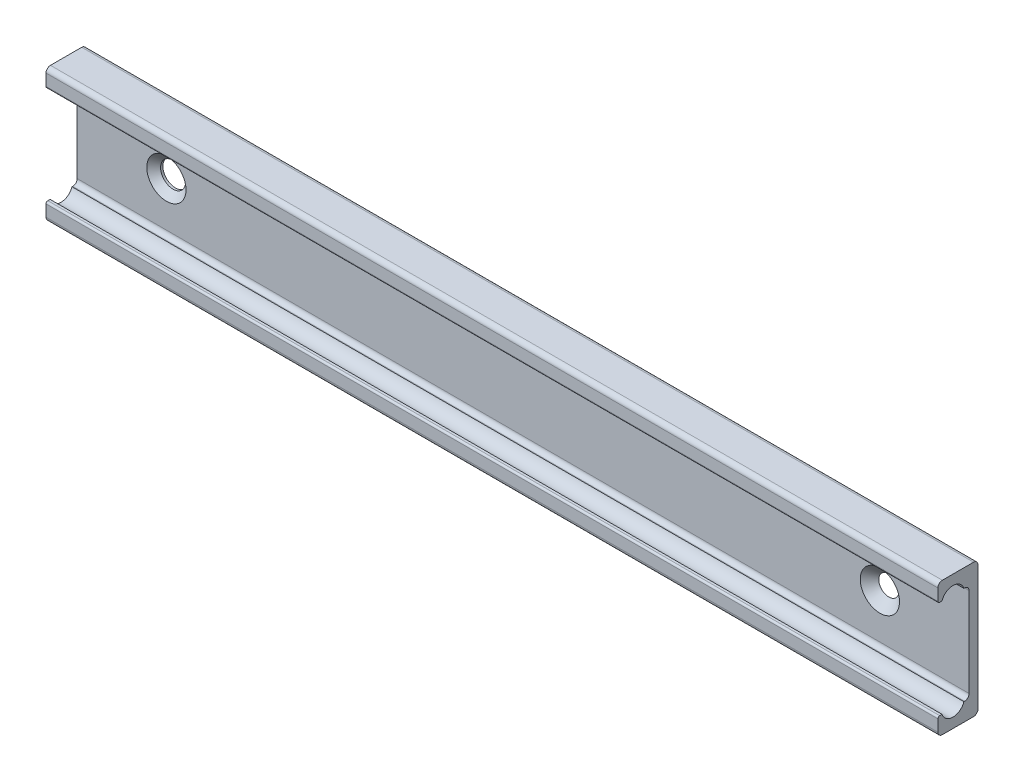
ISO-10303-21;
HEADER;
FILE_DESCRIPTION(('STEP AP214'),'2;1');
FILE_NAME('part.step','',(''),(''),'','','');
FILE_SCHEMA(('AUTOMOTIVE_DESIGN { 1 0 10303 214 1 1 1 1 }'));
ENDSEC;
DATA;
#1=APPLICATION_CONTEXT('core data for automotive mechanical design processes');
#2=APPLICATION_PROTOCOL_DEFINITION('international standard','automotive_design',2000,#1);
#3=PRODUCT_CONTEXT('',#1,'mechanical');
#4=PRODUCT('Part','Part','',(#3));
#5=PRODUCT_RELATED_PRODUCT_CATEGORY('part','',(#4));
#6=PRODUCT_DEFINITION_FORMATION('','',#4);
#7=PRODUCT_DEFINITION_CONTEXT('part definition',#1,'design');
#8=PRODUCT_DEFINITION('design','',#6,#7);
#9=PRODUCT_DEFINITION_SHAPE('','',#8);
#10=(LENGTH_UNIT() NAMED_UNIT(*) SI_UNIT(.MILLI.,.METRE.));
#11=(NAMED_UNIT(*) PLANE_ANGLE_UNIT() SI_UNIT($,.RADIAN.));
#12=(NAMED_UNIT(*) SI_UNIT($,.STERADIAN.) SOLID_ANGLE_UNIT());
#13=UNCERTAINTY_MEASURE_WITH_UNIT(LENGTH_MEASURE(1.E-05),#10,'distance_accuracy_value','');
#14=(GEOMETRIC_REPRESENTATION_CONTEXT(3) GLOBAL_UNCERTAINTY_ASSIGNED_CONTEXT((#13)) GLOBAL_UNIT_ASSIGNED_CONTEXT((#10,
#11,#12)) REPRESENTATION_CONTEXT('',''));
#15=CARTESIAN_POINT('',(0.,0.,0.));
#16=DIRECTION('',(0.,0.,1.));
#17=DIRECTION('',(1.,0.,0.));
#18=AXIS2_PLACEMENT_3D('',#15,#16,#17);
#19=CARTESIAN_POINT('',(90.,5.69999999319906,4.5));
#20=DIRECTION('',(0.,0.,1.));
#21=DIRECTION('',(1.,0.,0.));
#22=AXIS2_PLACEMENT_3D('',#19,#20,#21);
#23=PLANE('',#22);
#24=DIRECTION('',(0.,1.,0.));
#25=VECTOR('',#24,1.);
#26=CARTESIAN_POINT('',(-10.,5.69999999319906,4.5));
#27=LINE('',#26,#25);
#28=CARTESIAN_POINT('',(-10.,5.69999999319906,4.5));
#29=VERTEX_POINT('',#28);
#30=CARTESIAN_POINT('',(-10.,7.,4.5));
#31=VERTEX_POINT('',#30);
#32=EDGE_CURVE('E258',#29,#31,#27,.T.);
#33=ORIENTED_EDGE('',*,*,#32,.F.);
#34=DIRECTION('',(-1.,0.,0.));
#35=VECTOR('',#34,1.);
#36=CARTESIAN_POINT('',(90.,5.69999999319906,4.5));
#37=LINE('',#36,#35);
#38=CARTESIAN_POINT('',(90.,5.69999999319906,4.5));
#39=VERTEX_POINT('',#38);
#40=EDGE_CURVE('E9',#39,#29,#37,.T.);
#41=ORIENTED_EDGE('',*,*,#40,.F.);
#42=DIRECTION('',(0.,1.,0.));
#43=VECTOR('',#42,1.);
#44=CARTESIAN_POINT('',(90.,5.69999999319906,4.5));
#45=LINE('',#44,#43);
#46=CARTESIAN_POINT('',(90.,7.,4.5));
#47=VERTEX_POINT('',#46);
#48=EDGE_CURVE('E197',#39,#47,#45,.T.);
#49=ORIENTED_EDGE('',*,*,#48,.T.);
#50=DIRECTION('',(-1.,0.,0.));
#51=VECTOR('',#50,1.);
#52=CARTESIAN_POINT('',(94.5334865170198,7.,4.5));
#53=LINE('',#52,#51);
#54=EDGE_CURVE('E294',#47,#31,#53,.T.);
#55=ORIENTED_EDGE('',*,*,#54,.T.);
#56=EDGE_LOOP('',(#33,#41,#49,#55));
#57=FACE_BOUND('',#56,.T.);
#58=ADVANCED_FACE('F14',(#57),#23,.T.);
#59=CARTESIAN_POINT('',(90.,5.69999999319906,4.3));
#60=DIRECTION('',(-1.,0.,0.));
#61=DIRECTION('',(0.,0.,1.));
#62=AXIS2_PLACEMENT_3D('',#59,#60,#61);
#63=CYLINDRICAL_SURFACE('',#62,0.2);
#64=CARTESIAN_POINT('',(-10.,5.69999999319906,4.3));
#65=DIRECTION('',(-1.,0.,0.));
#66=DIRECTION('',(0.,0.,-1.));
#67=AXIS2_PLACEMENT_3D('',#64,#65,#66);
#68=CIRCLE('',#67,0.2);
#69=CARTESIAN_POINT('',(-10.,5.49999999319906,4.3));
#70=VERTEX_POINT('',#69);
#71=EDGE_CURVE('E255',#70,#29,#68,.T.);
#72=ORIENTED_EDGE('',*,*,#71,.F.);
#73=DIRECTION('',(-1.,0.,0.));
#74=VECTOR('',#73,1.);
#75=CARTESIAN_POINT('',(90.,5.49999999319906,4.3));
#76=LINE('',#75,#74);
#77=CARTESIAN_POINT('',(90.,5.49999999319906,4.3));
#78=VERTEX_POINT('',#77);
#79=EDGE_CURVE('E23',#78,#70,#76,.T.);
#80=ORIENTED_EDGE('',*,*,#79,.F.);
#81=CARTESIAN_POINT('',(90.,5.69999999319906,4.3));
#82=DIRECTION('',(-1.,0.,0.));
#83=DIRECTION('',(0.,0.,-1.));
#84=AXIS2_PLACEMENT_3D('',#81,#82,#83);
#85=CIRCLE('',#84,0.2);
#86=EDGE_CURVE('E194',#78,#39,#85,.T.);
#87=ORIENTED_EDGE('',*,*,#86,.T.);
#88=ORIENTED_EDGE('',*,*,#40,.T.);
#89=EDGE_LOOP('',(#72,#80,#87,#88));
#90=FACE_BOUND('',#89,.T.);
#91=ADVANCED_FACE('F330',(#90),#63,.T.);
#92=CARTESIAN_POINT('',(90.,5.49999999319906,3.97687617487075));
#93=DIRECTION('',(0.,-1.,0.));
#94=DIRECTION('',(1.,0.,0.));
#95=AXIS2_PLACEMENT_3D('',#92,#93,#94);
#96=PLANE('',#95);
#97=DIRECTION('',(-1.,0.,0.));
#98=VECTOR('',#97,1.);
#99=CARTESIAN_POINT('',(90.,5.49999999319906,4.03641754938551));
#100=LINE('',#99,#98);
#101=CARTESIAN_POINT('',(90.,5.49999999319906,4.03641754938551));
#102=VERTEX_POINT('',#101);
#103=CARTESIAN_POINT('',(-10.,5.49999999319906,4.03641754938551));
#104=VERTEX_POINT('',#103);
#105=EDGE_CURVE('E31',#102,#104,#100,.T.);
#106=ORIENTED_EDGE('',*,*,#105,.F.);
#107=DIRECTION('',(0.,0.,1.));
#108=VECTOR('',#107,1.);
#109=CARTESIAN_POINT('',(90.,5.49999999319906,3.97687617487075));
#110=LINE('',#109,#108);
#111=EDGE_CURVE('E192',#102,#78,#110,.T.);
#112=ORIENTED_EDGE('',*,*,#111,.T.);
#113=ORIENTED_EDGE('',*,*,#79,.T.);
#114=DIRECTION('',(0.,0.,1.));
#115=VECTOR('',#114,1.);
#116=CARTESIAN_POINT('',(-10.,5.49999999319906,3.97687617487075));
#117=LINE('',#116,#115);
#118=EDGE_CURVE('E253',#104,#70,#117,.T.);
#119=ORIENTED_EDGE('',*,*,#118,.F.);
#120=EDGE_LOOP('',(#106,#112,#113,#119));
#121=FACE_BOUND('',#120,.T.);
#122=ADVANCED_FACE('F394',(#121),#96,.T.);
#123=CARTESIAN_POINT('',(90.,5.5,1.5));
#124=DIRECTION('',(0.,-1.,-4.7517935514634E-08));
#125=DIRECTION('',(0.,-4.7517935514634E-08,1.));
#126=AXIS2_PLACEMENT_3D('',#123,#124,#125);
#127=PLANE('',#126);
#128=DIRECTION('',(-1.,0.,0.));
#129=VECTOR('',#128,1.);
#130=CARTESIAN_POINT('',(90.,5.49999999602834,1.58358245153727));
#131=LINE('',#130,#129);
#132=CARTESIAN_POINT('',(-10.,5.49999999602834,1.58358245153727));
#133=VERTEX_POINT('',#132);
#134=CARTESIAN_POINT('',(90.,5.49999999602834,1.58358245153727));
#135=VERTEX_POINT('',#134);
#136=EDGE_CURVE('E168',#133,#135,#131,.F.);
#137=ORIENTED_EDGE('',*,*,#136,.F.);
#138=DIRECTION('',(0.,-4.7517935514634E-08,1.));
#139=VECTOR('',#138,1.);
#140=CARTESIAN_POINT('',(-10.,5.5,1.5));
#141=LINE('',#140,#139);
#142=CARTESIAN_POINT('',(-10.,5.5,1.5));
#143=VERTEX_POINT('',#142);
#144=EDGE_CURVE('E250',#143,#133,#141,.T.);
#145=ORIENTED_EDGE('',*,*,#144,.F.);
#146=DIRECTION('',(-1.,0.,0.));
#147=VECTOR('',#146,1.);
#148=CARTESIAN_POINT('',(90.,5.5,1.5));
#149=LINE('',#148,#147);
#150=CARTESIAN_POINT('',(90.,5.5,1.5));
#151=VERTEX_POINT('',#150);
#152=EDGE_CURVE('E202',#151,#143,#149,.T.);
#153=ORIENTED_EDGE('',*,*,#152,.F.);
#154=DIRECTION('',(0.,-4.7517935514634E-08,1.));
#155=VECTOR('',#154,1.);
#156=CARTESIAN_POINT('',(90.,5.5,1.5));
#157=LINE('',#156,#155);
#158=EDGE_CURVE('E189',#151,#135,#157,.T.);
#159=ORIENTED_EDGE('',*,*,#158,.T.);
#160=EDGE_LOOP('',(#137,#145,#153,#159));
#161=FACE_BOUND('',#160,.T.);
#162=ADVANCED_FACE('F382',(#161),#127,.T.);
#163=CARTESIAN_POINT('',(90.,5.,1.5));
#164=DIRECTION('',(-1.,0.,0.));
#165=DIRECTION('',(0.,0.,1.));
#166=AXIS2_PLACEMENT_3D('',#163,#164,#165);
#167=CYLINDRICAL_SURFACE('',#166,0.5);
#168=CARTESIAN_POINT('',(-10.,5.,1.5));
#169=DIRECTION('',(1.,0.,0.));
#170=DIRECTION('',(0.,0.,1.));
#171=AXIS2_PLACEMENT_3D('',#168,#169,#170);
#172=CIRCLE('',#171,0.5);
#173=CARTESIAN_POINT('',(-10.,5.,1.));
#174=VERTEX_POINT('',#173);
#175=EDGE_CURVE('E247',#174,#143,#172,.T.);
#176=ORIENTED_EDGE('',*,*,#175,.F.);
#177=DIRECTION('',(-1.,0.,0.));
#178=VECTOR('',#177,1.);
#179=CARTESIAN_POINT('',(90.,5.,1.));
#180=LINE('',#179,#178);
#181=CARTESIAN_POINT('',(90.,5.,1.));
#182=VERTEX_POINT('',#181);
#183=EDGE_CURVE('E204',#182,#174,#180,.T.);
#184=ORIENTED_EDGE('',*,*,#183,.F.);
#185=CARTESIAN_POINT('',(90.,5.,1.5));
#186=DIRECTION('',(1.,0.,0.));
#187=DIRECTION('',(0.,0.,1.));
#188=AXIS2_PLACEMENT_3D('',#185,#186,#187);
#189=CIRCLE('',#188,0.5);
#190=EDGE_CURVE('E186',#182,#151,#189,.T.);
#191=ORIENTED_EDGE('',*,*,#190,.T.);
#192=ORIENTED_EDGE('',*,*,#152,.T.);
#193=EDGE_LOOP('',(#176,#184,#191,#192));
#194=FACE_BOUND('',#193,.T.);
#195=ADVANCED_FACE('F385',(#194),#167,.F.);
#196=CARTESIAN_POINT('',(90.,-5.,1.));
#197=DIRECTION('',(0.,0.,1.));
#198=DIRECTION('',(1.,0.,0.));
#199=AXIS2_PLACEMENT_3D('',#196,#197,#198);
#200=PLANE('',#199);
#201=CARTESIAN_POINT('',(80.,0.,1.));
#202=DIRECTION('',(0.,0.,1.));
#203=DIRECTION('',(1.,0.,0.));
#204=AXIS2_PLACEMENT_3D('',#201,#202,#203);
#205=CIRCLE('',#204,2.2);
#206=CARTESIAN_POINT('',(82.2,0.,1.));
#207=VERTEX_POINT('',#206);
#208=EDGE_CURVE('E226',#207,#207,#205,.T.);
#209=ORIENTED_EDGE('',*,*,#208,.F.);
#210=EDGE_LOOP('',(#209));
#211=FACE_BOUND('',#210,.T.);
#212=CARTESIAN_POINT('',(0.,0.,1.));
#213=DIRECTION('',(0.,0.,1.));
#214=DIRECTION('',(1.,0.,0.));
#215=AXIS2_PLACEMENT_3D('',#212,#213,#214);
#216=CIRCLE('',#215,2.2);
#217=CARTESIAN_POINT('',(2.2,0.,1.));
#218=VERTEX_POINT('',#217);
#219=EDGE_CURVE('E214',#218,#218,#216,.T.);
#220=ORIENTED_EDGE('',*,*,#219,.F.);
#221=EDGE_LOOP('',(#220));
#222=FACE_BOUND('',#221,.T.);
#223=DIRECTION('',(0.,1.,0.));
#224=VECTOR('',#223,1.);
#225=CARTESIAN_POINT('',(-10.,-5.,1.));
#226=LINE('',#225,#224);
#227=CARTESIAN_POINT('',(-10.,-5.,1.));
#228=VERTEX_POINT('',#227);
#229=EDGE_CURVE('E244',#228,#174,#226,.T.);
#230=ORIENTED_EDGE('',*,*,#229,.F.);
#231=DIRECTION('',(-1.,0.,0.));
#232=VECTOR('',#231,1.);
#233=CARTESIAN_POINT('',(90.,-5.,1.));
#234=LINE('',#233,#232);
#235=CARTESIAN_POINT('',(90.,-5.,1.));
#236=VERTEX_POINT('',#235);
#237=EDGE_CURVE('E206',#236,#228,#234,.T.);
#238=ORIENTED_EDGE('',*,*,#237,.F.);
#239=DIRECTION('',(0.,1.,0.));
#240=VECTOR('',#239,1.);
#241=CARTESIAN_POINT('',(90.,-5.,1.));
#242=LINE('',#241,#240);
#243=EDGE_CURVE('E178',#236,#182,#242,.T.);
#244=ORIENTED_EDGE('',*,*,#243,.T.);
#245=ORIENTED_EDGE('',*,*,#183,.T.);
#246=EDGE_LOOP('',(#230,#238,#244,#245));
#247=FACE_BOUND('',#246,.T.);
#248=ADVANCED_FACE('F388',(#211,#222,#247),#200,.T.);
#249=CARTESIAN_POINT('',(90.,-5.,1.5));
#250=DIRECTION('',(-1.,0.,0.));
#251=DIRECTION('',(0.,0.,1.));
#252=AXIS2_PLACEMENT_3D('',#249,#250,#251);
#253=CYLINDRICAL_SURFACE('',#252,0.5);
#254=CARTESIAN_POINT('',(-10.,-5.,1.5));
#255=DIRECTION('',(1.,0.,0.));
#256=DIRECTION('',(0.,0.,-1.));
#257=AXIS2_PLACEMENT_3D('',#254,#255,#256);
#258=CIRCLE('',#257,0.5);
#259=CARTESIAN_POINT('',(-10.,-5.5,1.5));
#260=VERTEX_POINT('',#259);
#261=EDGE_CURVE('E241',#260,#228,#258,.T.);
#262=ORIENTED_EDGE('',*,*,#261,.F.);
#263=DIRECTION('',(-1.,0.,0.));
#264=VECTOR('',#263,1.);
#265=CARTESIAN_POINT('',(90.,-5.5,1.5));
#266=LINE('',#265,#264);
#267=CARTESIAN_POINT('',(90.,-5.5,1.5));
#268=VERTEX_POINT('',#267);
#269=EDGE_CURVE('E208',#268,#260,#266,.T.);
#270=ORIENTED_EDGE('',*,*,#269,.F.);
#271=CARTESIAN_POINT('',(90.,-5.,1.5));
#272=DIRECTION('',(1.,0.,0.));
#273=DIRECTION('',(0.,0.,-1.));
#274=AXIS2_PLACEMENT_3D('',#271,#272,#273);
#275=CIRCLE('',#274,0.5);
#276=EDGE_CURVE('E175',#268,#236,#275,.T.);
#277=ORIENTED_EDGE('',*,*,#276,.T.);
#278=ORIENTED_EDGE('',*,*,#237,.T.);
#279=EDGE_LOOP('',(#262,#270,#277,#278));
#280=FACE_BOUND('',#279,.T.);
#281=ADVANCED_FACE('F391',(#280),#253,.F.);
#282=CARTESIAN_POINT('',(90.,-5.5,1.5));
#283=DIRECTION('',(0.,1.,-4.7517935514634E-08));
#284=DIRECTION('',(0.,-4.7517935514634E-08,-1.));
#285=AXIS2_PLACEMENT_3D('',#282,#283,#284);
#286=PLANE('',#285);
#287=DIRECTION('',(-1.,0.,0.));
#288=VECTOR('',#287,1.);
#289=CARTESIAN_POINT('',(90.,-5.49999999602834,1.58358245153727));
#290=LINE('',#289,#288);
#291=CARTESIAN_POINT('',(90.,-5.49999999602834,1.58358245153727));
#292=VERTEX_POINT('',#291);
#293=CARTESIAN_POINT('',(-10.,-5.49999999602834,1.58358245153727));
#294=VERTEX_POINT('',#293);
#295=EDGE_CURVE('E39',#292,#294,#290,.T.);
#296=ORIENTED_EDGE('',*,*,#295,.F.);
#297=DIRECTION('',(0.,-4.7517935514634E-08,-1.));
#298=VECTOR('',#297,1.);
#299=CARTESIAN_POINT('',(90.,-5.5,1.5));
#300=LINE('',#299,#298);
#301=EDGE_CURVE('E165',#292,#268,#300,.T.);
#302=ORIENTED_EDGE('',*,*,#301,.T.);
#303=ORIENTED_EDGE('',*,*,#269,.T.);
#304=DIRECTION('',(0.,-4.7517935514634E-08,-1.));
#305=VECTOR('',#304,1.);
#306=CARTESIAN_POINT('',(-10.,-5.5,1.5));
#307=LINE('',#306,#305);
#308=EDGE_CURVE('E167',#294,#260,#307,.T.);
#309=ORIENTED_EDGE('',*,*,#308,.F.);
#310=EDGE_LOOP('',(#296,#302,#303,#309));
#311=FACE_BOUND('',#310,.T.);
#312=ADVANCED_FACE('F163',(#311),#286,.T.);
#313=CARTESIAN_POINT('',(90.,-5.49999999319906,3.97687617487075));
#314=DIRECTION('',(0.,1.,0.));
#315=DIRECTION('',(-1.,0.,0.));
#316=AXIS2_PLACEMENT_3D('',#313,#314,#315);
#317=PLANE('',#316);
#318=DIRECTION('',(-1.,0.,0.));
#319=VECTOR('',#318,1.);
#320=CARTESIAN_POINT('',(90.,-5.49999999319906,4.03641754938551));
#321=LINE('',#320,#319);
#322=CARTESIAN_POINT('',(-10.,-5.49999999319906,4.03641754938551));
#323=VERTEX_POINT('',#322);
#324=CARTESIAN_POINT('',(90.,-5.49999999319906,4.03641754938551));
#325=VERTEX_POINT('',#324);
#326=EDGE_CURVE('E153',#323,#325,#321,.F.);
#327=ORIENTED_EDGE('',*,*,#326,.F.);
#328=DIRECTION('',(0.,0.,-1.));
#329=VECTOR('',#328,1.);
#330=CARTESIAN_POINT('',(-10.,-5.49999999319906,3.97687617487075));
#331=LINE('',#330,#329);
#332=CARTESIAN_POINT('',(-10.,-5.49999999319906,4.3));
#333=VERTEX_POINT('',#332);
#334=EDGE_CURVE('E237',#333,#323,#331,.T.);
#335=ORIENTED_EDGE('',*,*,#334,.F.);
#336=DIRECTION('',(-1.,0.,0.));
#337=VECTOR('',#336,1.);
#338=CARTESIAN_POINT('',(90.,-5.49999999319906,4.3));
#339=LINE('',#338,#337);
#340=CARTESIAN_POINT('',(90.,-5.49999999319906,4.3));
#341=VERTEX_POINT('',#340);
#342=EDGE_CURVE('E210',#341,#333,#339,.T.);
#343=ORIENTED_EDGE('',*,*,#342,.F.);
#344=DIRECTION('',(0.,0.,-1.));
#345=VECTOR('',#344,1.);
#346=CARTESIAN_POINT('',(90.,-5.49999999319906,3.97687617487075));
#347=LINE('',#346,#345);
#348=EDGE_CURVE('E176',#341,#325,#347,.T.);
#349=ORIENTED_EDGE('',*,*,#348,.T.);
#350=EDGE_LOOP('',(#327,#335,#343,#349));
#351=FACE_BOUND('',#350,.T.);
#352=ADVANCED_FACE('F370',(#351),#317,.T.);
#353=CARTESIAN_POINT('',(90.,-5.69999999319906,4.3));
#354=DIRECTION('',(-1.,0.,0.));
#355=DIRECTION('',(0.,0.,1.));
#356=AXIS2_PLACEMENT_3D('',#353,#354,#355);
#357=CYLINDRICAL_SURFACE('',#356,0.2);
#358=CARTESIAN_POINT('',(-10.,-5.69999999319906,4.3));
#359=DIRECTION('',(-1.,0.,0.));
#360=DIRECTION('',(0.,0.,1.));
#361=AXIS2_PLACEMENT_3D('',#358,#359,#360);
#362=CIRCLE('',#361,0.2);
#363=CARTESIAN_POINT('',(-10.,-5.69999999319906,4.5));
#364=VERTEX_POINT('',#363);
#365=EDGE_CURVE('E234',#364,#333,#362,.T.);
#366=ORIENTED_EDGE('',*,*,#365,.F.);
#367=DIRECTION('',(-1.,0.,0.));
#368=VECTOR('',#367,1.);
#369=CARTESIAN_POINT('',(90.,-5.69999999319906,4.5));
#370=LINE('',#369,#368);
#371=CARTESIAN_POINT('',(90.,-5.69999999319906,4.5));
#372=VERTEX_POINT('',#371);
#373=EDGE_CURVE('E198',#372,#364,#370,.T.);
#374=ORIENTED_EDGE('',*,*,#373,.F.);
#375=CARTESIAN_POINT('',(90.,-5.69999999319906,4.3));
#376=DIRECTION('',(-1.,0.,0.));
#377=DIRECTION('',(0.,0.,1.));
#378=AXIS2_PLACEMENT_3D('',#375,#376,#377);
#379=CIRCLE('',#378,0.2);
#380=EDGE_CURVE('E180',#372,#341,#379,.T.);
#381=ORIENTED_EDGE('',*,*,#380,.T.);
#382=ORIENTED_EDGE('',*,*,#342,.T.);
#383=EDGE_LOOP('',(#366,#374,#381,#382));
#384=FACE_BOUND('',#383,.T.);
#385=ADVANCED_FACE('F268',(#384),#357,.T.);
#386=CARTESIAN_POINT('',(90.,-5.69999999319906,4.5));
#387=DIRECTION('',(0.,0.,1.));
#388=DIRECTION('',(1.,0.,0.));
#389=AXIS2_PLACEMENT_3D('',#386,#387,#388);
#390=PLANE('',#389);
#391=DIRECTION('',(0.,1.,0.));
#392=VECTOR('',#391,1.);
#393=CARTESIAN_POINT('',(-10.,-5.69999999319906,4.5));
#394=LINE('',#393,#392);
#395=CARTESIAN_POINT('',(-10.,-7.,4.5));
#396=VERTEX_POINT('',#395);
#397=EDGE_CURVE('E231',#396,#364,#394,.T.);
#398=ORIENTED_EDGE('',*,*,#397,.F.);
#399=DIRECTION('',(-1.,0.,0.));
#400=VECTOR('',#399,1.);
#401=CARTESIAN_POINT('',(94.5334865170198,-7.,4.5));
#402=LINE('',#401,#400);
#403=CARTESIAN_POINT('',(90.,-7.,4.5));
#404=VERTEX_POINT('',#403);
#405=EDGE_CURVE('E275',#404,#396,#402,.T.);
#406=ORIENTED_EDGE('',*,*,#405,.F.);
#407=DIRECTION('',(0.,1.,0.));
#408=VECTOR('',#407,1.);
#409=CARTESIAN_POINT('',(90.,-5.69999999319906,4.5));
#410=LINE('',#409,#408);
#411=EDGE_CURVE('E262',#404,#372,#410,.T.);
#412=ORIENTED_EDGE('',*,*,#411,.T.);
#413=ORIENTED_EDGE('',*,*,#373,.T.);
#414=EDGE_LOOP('',(#398,#406,#412,#413));
#415=FACE_BOUND('',#414,.T.);
#416=ADVANCED_FACE('F273',(#415),#390,.T.);
#417=CARTESIAN_POINT('',(90.,-6.95,0.));
#418=DIRECTION('',(0.,0.,-1.));
#419=DIRECTION('',(-1.,0.,0.));
#420=AXIS2_PLACEMENT_3D('',#417,#418,#419);
#421=PLANE('',#420);
#422=CARTESIAN_POINT('',(80.,0.,0.));
#423=DIRECTION('',(0.,0.,-1.));
#424=DIRECTION('',(-1.,0.,0.));
#425=AXIS2_PLACEMENT_3D('',#422,#423,#424);
#426=CIRCLE('',#425,1.12763128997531);
#427=CARTESIAN_POINT('',(78.8723687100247,0.,0.));
#428=VERTEX_POINT('',#427);
#429=EDGE_CURVE('E18',#428,#428,#426,.T.);
#430=ORIENTED_EDGE('',*,*,#429,.F.);
#431=EDGE_LOOP('',(#430));
#432=FACE_BOUND('',#431,.T.);
#433=CARTESIAN_POINT('',(0.,0.,0.));
#434=DIRECTION('',(0.,0.,1.));
#435=DIRECTION('',(1.,0.,0.));
#436=AXIS2_PLACEMENT_3D('',#433,#434,#435);
#437=CIRCLE('',#436,1.4);
#438=CARTESIAN_POINT('',(1.4,0.,0.));
#439=VERTEX_POINT('',#438);
#440=EDGE_CURVE('E215',#439,#439,#437,.T.);
#441=ORIENTED_EDGE('',*,*,#440,.T.);
#442=EDGE_LOOP('',(#441));
#443=FACE_BOUND('',#442,.T.);
#444=DIRECTION('',(0.,-1.,0.));
#445=VECTOR('',#444,1.);
#446=CARTESIAN_POINT('',(-10.,-6.95,0.));
#447=LINE('',#446,#445);
#448=CARTESIAN_POINT('',(-10.,7.,0.));
#449=VERTEX_POINT('',#448);
#450=CARTESIAN_POINT('',(-10.,-7.,0.));
#451=VERTEX_POINT('',#450);
#452=EDGE_CURVE('E219',#449,#451,#447,.T.);
#453=ORIENTED_EDGE('',*,*,#452,.F.);
#454=DIRECTION('',(-1.,0.,0.));
#455=VECTOR('',#454,1.);
#456=CARTESIAN_POINT('',(94.5334865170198,7.,0.));
#457=LINE('',#456,#455);
#458=CARTESIAN_POINT('',(90.,7.,0.));
#459=VERTEX_POINT('',#458);
#460=EDGE_CURVE('E300',#459,#449,#457,.T.);
#461=ORIENTED_EDGE('',*,*,#460,.F.);
#462=DIRECTION('',(0.,-1.,0.));
#463=VECTOR('',#462,1.);
#464=CARTESIAN_POINT('',(90.,-6.95,0.));
#465=LINE('',#464,#463);
#466=CARTESIAN_POINT('',(90.,-7.,0.));
#467=VERTEX_POINT('',#466);
#468=EDGE_CURVE('E260',#459,#467,#465,.T.);
#469=ORIENTED_EDGE('',*,*,#468,.T.);
#470=DIRECTION('',(-1.,0.,0.));
#471=VECTOR('',#470,1.);
#472=CARTESIAN_POINT('',(94.5334865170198,-7.,0.));
#473=LINE('',#472,#471);
#474=EDGE_CURVE('E289',#467,#451,#473,.T.);
#475=ORIENTED_EDGE('',*,*,#474,.T.);
#476=EDGE_LOOP('',(#453,#461,#469,#475));
#477=FACE_BOUND('',#476,.T.);
#478=ADVANCED_FACE('F16',(#432,#443,#477),#421,.T.);
#479=CARTESIAN_POINT('',(90.,6.95,0.5));
#480=DIRECTION('',(1.,0.,0.));
#481=DIRECTION('',(0.,0.,-1.));
#482=AXIS2_PLACEMENT_3D('',#479,#480,#481);
#483=PLANE('',#482);
#484=CARTESIAN_POINT('',(90.,5.1,2.81));
#485=DIRECTION('',(-1.,0.,0.));
#486=DIRECTION('',(0.,0.,1.));
#487=AXIS2_PLACEMENT_3D('',#484,#485,#486);
#488=CIRCLE('',#487,1.29);
#489=EDGE_CURVE('E371',#102,#135,#488,.T.);
#490=ORIENTED_EDGE('',*,*,#489,.T.);
#491=ORIENTED_EDGE('',*,*,#158,.F.);
#492=ORIENTED_EDGE('',*,*,#190,.F.);
#493=ORIENTED_EDGE('',*,*,#243,.F.);
#494=ORIENTED_EDGE('',*,*,#276,.F.);
#495=ORIENTED_EDGE('',*,*,#301,.F.);
#496=CARTESIAN_POINT('',(90.,-5.1,2.81));
#497=DIRECTION('',(-1.,0.,0.));
#498=DIRECTION('',(0.,0.,-1.));
#499=AXIS2_PLACEMENT_3D('',#496,#497,#498);
#500=CIRCLE('',#499,1.29);
#501=EDGE_CURVE('E150',#292,#325,#500,.T.);
#502=ORIENTED_EDGE('',*,*,#501,.T.);
#503=ORIENTED_EDGE('',*,*,#348,.F.);
#504=ORIENTED_EDGE('',*,*,#380,.F.);
#505=ORIENTED_EDGE('',*,*,#411,.F.);
#506=CARTESIAN_POINT('',(90.,-7.,4.));
#507=DIRECTION('',(1.,0.,0.));
#508=DIRECTION('',(0.,0.,-1.));
#509=AXIS2_PLACEMENT_3D('',#506,#507,#508);
#510=CIRCLE('',#509,0.5);
#511=CARTESIAN_POINT('',(90.,-7.5,4.));
#512=VERTEX_POINT('',#511);
#513=EDGE_CURVE('E280',#512,#404,#510,.F.);
#514=ORIENTED_EDGE('',*,*,#513,.F.);
#515=DIRECTION('',(0.,0.,1.));
#516=VECTOR('',#515,1.);
#517=CARTESIAN_POINT('',(90.,-7.5,0.5));
#518=LINE('',#517,#516);
#519=CARTESIAN_POINT('',(90.,-7.5,0.5));
#520=VERTEX_POINT('',#519);
#521=EDGE_CURVE('E361',#520,#512,#518,.T.);
#522=ORIENTED_EDGE('',*,*,#521,.F.);
#523=CARTESIAN_POINT('',(90.,-7.,0.5));
#524=DIRECTION('',(1.,0.,0.));
#525=DIRECTION('',(0.,0.,-1.));
#526=AXIS2_PLACEMENT_3D('',#523,#524,#525);
#527=CIRCLE('',#526,0.5);
#528=EDGE_CURVE('E350',#467,#520,#527,.F.);
#529=ORIENTED_EDGE('',*,*,#528,.F.);
#530=ORIENTED_EDGE('',*,*,#468,.F.);
#531=CARTESIAN_POINT('',(90.,7.,0.5));
#532=DIRECTION('',(1.,0.,0.));
#533=DIRECTION('',(0.,0.,-1.));
#534=AXIS2_PLACEMENT_3D('',#531,#532,#533);
#535=CIRCLE('',#534,0.5);
#536=CARTESIAN_POINT('',(90.,7.5,0.5));
#537=VERTEX_POINT('',#536);
#538=EDGE_CURVE('E297',#537,#459,#535,.F.);
#539=ORIENTED_EDGE('',*,*,#538,.F.);
#540=DIRECTION('',(0.,0.,-1.));
#541=VECTOR('',#540,1.);
#542=CARTESIAN_POINT('',(90.,7.5,0.5));
#543=LINE('',#542,#541);
#544=CARTESIAN_POINT('',(90.,7.5,4.));
#545=VERTEX_POINT('',#544);
#546=EDGE_CURVE('E302',#545,#537,#543,.T.);
#547=ORIENTED_EDGE('',*,*,#546,.F.);
#548=CARTESIAN_POINT('',(90.,7.,4.));
#549=DIRECTION('',(1.,0.,0.));
#550=DIRECTION('',(0.,0.,-1.));
#551=AXIS2_PLACEMENT_3D('',#548,#549,#550);
#552=CIRCLE('',#551,0.5);
#553=EDGE_CURVE('E306',#47,#545,#552,.F.);
#554=ORIENTED_EDGE('',*,*,#553,.F.);
#555=ORIENTED_EDGE('',*,*,#48,.F.);
#556=ORIENTED_EDGE('',*,*,#86,.F.);
#557=ORIENTED_EDGE('',*,*,#111,.F.);
#558=EDGE_LOOP('',(#490,#491,#492,#493,#494,#495,#502,#503,#504,#505,#514,#522,#529,#530,#539,
#547,#554,#555,#556,#557));
#559=FACE_BOUND('',#558,.T.);
#560=ADVANCED_FACE('F172',(#559),#483,.T.);
#561=CARTESIAN_POINT('',(-10.,6.95,0.5));
#562=DIRECTION('',(1.,0.,0.));
#563=DIRECTION('',(0.,0.,-1.));
#564=AXIS2_PLACEMENT_3D('',#561,#562,#563);
#565=PLANE('',#564);
#566=ORIENTED_EDGE('',*,*,#144,.T.);
#567=CARTESIAN_POINT('',(-10.,5.1,2.81));
#568=DIRECTION('',(-1.,0.,0.));
#569=DIRECTION('',(0.,0.,1.));
#570=AXIS2_PLACEMENT_3D('',#567,#568,#569);
#571=CIRCLE('',#570,1.29);
#572=EDGE_CURVE('E158',#104,#133,#571,.T.);
#573=ORIENTED_EDGE('',*,*,#572,.F.);
#574=ORIENTED_EDGE('',*,*,#118,.T.);
#575=ORIENTED_EDGE('',*,*,#71,.T.);
#576=ORIENTED_EDGE('',*,*,#32,.T.);
#577=CARTESIAN_POINT('',(-10.,7.,4.));
#578=DIRECTION('',(-1.,0.,0.));
#579=DIRECTION('',(0.,0.,-1.));
#580=AXIS2_PLACEMENT_3D('',#577,#578,#579);
#581=CIRCLE('',#580,0.5);
#582=CARTESIAN_POINT('',(-10.,7.5,4.));
#583=VERTEX_POINT('',#582);
#584=EDGE_CURVE('E279',#31,#583,#581,.T.);
#585=ORIENTED_EDGE('',*,*,#584,.T.);
#586=DIRECTION('',(0.,0.,-1.));
#587=VECTOR('',#586,1.);
#588=CARTESIAN_POINT('',(-10.,7.5,0.5));
#589=LINE('',#588,#587);
#590=CARTESIAN_POINT('',(-10.,7.5,0.5));
#591=VERTEX_POINT('',#590);
#592=EDGE_CURVE('E283',#583,#591,#589,.T.);
#593=ORIENTED_EDGE('',*,*,#592,.T.);
#594=CARTESIAN_POINT('',(-10.,7.,0.5));
#595=DIRECTION('',(-1.,0.,0.));
#596=DIRECTION('',(0.,0.,-1.));
#597=AXIS2_PLACEMENT_3D('',#594,#595,#596);
#598=CIRCLE('',#597,0.5);
#599=EDGE_CURVE('E291',#591,#449,#598,.T.);
#600=ORIENTED_EDGE('',*,*,#599,.T.);
#601=ORIENTED_EDGE('',*,*,#452,.T.);
#602=CARTESIAN_POINT('',(-10.,-7.,0.5));
#603=DIRECTION('',(-1.,0.,0.));
#604=DIRECTION('',(0.,0.,1.));
#605=AXIS2_PLACEMENT_3D('',#602,#603,#604);
#606=CIRCLE('',#605,0.5);
#607=CARTESIAN_POINT('',(-10.,-7.5,0.5));
#608=VERTEX_POINT('',#607);
#609=EDGE_CURVE('E343',#451,#608,#606,.T.);
#610=ORIENTED_EDGE('',*,*,#609,.T.);
#611=DIRECTION('',(0.,0.,1.));
#612=VECTOR('',#611,1.);
#613=CARTESIAN_POINT('',(-10.,-7.5,0.5));
#614=LINE('',#613,#612);
#615=CARTESIAN_POINT('',(-10.,-7.5,4.));
#616=VERTEX_POINT('',#615);
#617=EDGE_CURVE('E351',#608,#616,#614,.T.);
#618=ORIENTED_EDGE('',*,*,#617,.T.);
#619=CARTESIAN_POINT('',(-10.,-7.,4.));
#620=DIRECTION('',(-1.,0.,0.));
#621=DIRECTION('',(0.,0.,1.));
#622=AXIS2_PLACEMENT_3D('',#619,#620,#621);
#623=CIRCLE('',#622,0.5);
#624=EDGE_CURVE('E355',#616,#396,#623,.T.);
#625=ORIENTED_EDGE('',*,*,#624,.T.);
#626=ORIENTED_EDGE('',*,*,#397,.T.);
#627=ORIENTED_EDGE('',*,*,#365,.T.);
#628=ORIENTED_EDGE('',*,*,#334,.T.);
#629=CARTESIAN_POINT('',(-10.,-5.1,2.81));
#630=DIRECTION('',(-1.,0.,0.));
#631=DIRECTION('',(0.,0.,-1.));
#632=AXIS2_PLACEMENT_3D('',#629,#630,#631);
#633=CIRCLE('',#632,1.29);
#634=EDGE_CURVE('E159',#294,#323,#633,.T.);
#635=ORIENTED_EDGE('',*,*,#634,.F.);
#636=ORIENTED_EDGE('',*,*,#308,.T.);
#637=ORIENTED_EDGE('',*,*,#261,.T.);
#638=ORIENTED_EDGE('',*,*,#229,.T.);
#639=ORIENTED_EDGE('',*,*,#175,.T.);
#640=EDGE_LOOP('',(#566,#573,#574,#575,#576,#585,#593,#600,#601,#610,#618,#625,#626,#627,#628,
#635,#636,#637,#638,#639));
#641=FACE_BOUND('',#640,.T.);
#642=ADVANCED_FACE('F324',(#641),#565,.F.);
#643=CARTESIAN_POINT('',(0.,0.,1.));
#644=DIRECTION('',(0.,0.,1.));
#645=DIRECTION('',(1.,0.,0.));
#646=AXIS2_PLACEMENT_3D('',#643,#644,#645);
#647=CONICAL_SURFACE('',#646,2.2,0.820304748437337);
#648=CARTESIAN_POINT('',(0.,0.,0.253987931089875));
#649=DIRECTION('',(0.,0.,1.));
#650=DIRECTION('',(1.,0.,0.));
#651=AXIS2_PLACEMENT_3D('',#648,#649,#650);
#652=CIRCLE('',#651,1.4);
#653=CARTESIAN_POINT('',(1.4,0.,0.253987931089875));
#654=VERTEX_POINT('',#653);
#655=EDGE_CURVE('E212',#654,#654,#652,.F.);
#656=ORIENTED_EDGE('',*,*,#655,.T.);
#657=EDGE_LOOP('',(#656));
#658=FACE_BOUND('',#657,.T.);
#659=ORIENTED_EDGE('',*,*,#219,.T.);
#660=EDGE_LOOP('',(#659));
#661=FACE_BOUND('',#660,.T.);
#662=ADVANCED_FACE('F415',(#658,#661),#647,.F.);
#663=CARTESIAN_POINT('',(0.,0.,0.));
#664=DIRECTION('',(0.,0.,1.));
#665=DIRECTION('',(1.,0.,0.));
#666=AXIS2_PLACEMENT_3D('',#663,#664,#665);
#667=CYLINDRICAL_SURFACE('',#666,1.4);
#668=ORIENTED_EDGE('',*,*,#440,.F.);
#669=EDGE_LOOP('',(#668));
#670=FACE_BOUND('',#669,.T.);
#671=ORIENTED_EDGE('',*,*,#655,.F.);
#672=EDGE_LOOP('',(#671));
#673=FACE_BOUND('',#672,.T.);
#674=ADVANCED_FACE('F418',(#670,#673),#667,.F.);
#675=CARTESIAN_POINT('',(80.,0.,1.));
#676=DIRECTION('',(0.,0.,1.));
#677=DIRECTION('',(1.,0.,0.));
#678=AXIS2_PLACEMENT_3D('',#675,#676,#677);
#679=CONICAL_SURFACE('',#678,2.2,0.820304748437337);
#680=ORIENTED_EDGE('',*,*,#429,.T.);
#681=EDGE_LOOP('',(#680));
#682=FACE_BOUND('',#681,.T.);
#683=ORIENTED_EDGE('',*,*,#208,.T.);
#684=EDGE_LOOP('',(#683));
#685=FACE_BOUND('',#684,.T.);
#686=ADVANCED_FACE('F421',(#682,#685),#679,.F.);
#687=CARTESIAN_POINT('',(94.5334865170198,7.,4.));
#688=DIRECTION('',(-1.,0.,0.));
#689=DIRECTION('',(0.,0.,1.));
#690=AXIS2_PLACEMENT_3D('',#687,#688,#689);
#691=CYLINDRICAL_SURFACE('',#690,0.5);
#692=ORIENTED_EDGE('',*,*,#54,.F.);
#693=ORIENTED_EDGE('',*,*,#553,.T.);
#694=DIRECTION('',(-1.,0.,0.));
#695=VECTOR('',#694,1.);
#696=CARTESIAN_POINT('',(94.5334865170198,7.5,4.));
#697=LINE('',#696,#695);
#698=EDGE_CURVE('E305',#545,#583,#697,.T.);
#699=ORIENTED_EDGE('',*,*,#698,.T.);
#700=ORIENTED_EDGE('',*,*,#584,.F.);
#701=EDGE_LOOP('',(#692,#693,#699,#700));
#702=FACE_BOUND('',#701,.T.);
#703=ADVANCED_FACE('F320',(#702),#691,.T.);
#704=CARTESIAN_POINT('',(94.5334865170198,7.5,0.5));
#705=DIRECTION('',(0.,1.,0.));
#706=DIRECTION('',(-1.,0.,0.));
#707=AXIS2_PLACEMENT_3D('',#704,#705,#706);
#708=PLANE('',#707);
#709=ORIENTED_EDGE('',*,*,#698,.F.);
#710=ORIENTED_EDGE('',*,*,#546,.T.);
#711=DIRECTION('',(-1.,0.,0.));
#712=VECTOR('',#711,1.);
#713=CARTESIAN_POINT('',(94.5334865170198,7.5,0.5));
#714=LINE('',#713,#712);
#715=EDGE_CURVE('E301',#537,#591,#714,.T.);
#716=ORIENTED_EDGE('',*,*,#715,.T.);
#717=ORIENTED_EDGE('',*,*,#592,.F.);
#718=EDGE_LOOP('',(#709,#710,#716,#717));
#719=FACE_BOUND('',#718,.T.);
#720=ADVANCED_FACE('F335',(#719),#708,.T.);
#721=CARTESIAN_POINT('',(94.5334865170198,7.,0.5));
#722=DIRECTION('',(-1.,0.,0.));
#723=DIRECTION('',(0.,0.,1.));
#724=AXIS2_PLACEMENT_3D('',#721,#722,#723);
#725=CYLINDRICAL_SURFACE('',#724,0.5);
#726=ORIENTED_EDGE('',*,*,#715,.F.);
#727=ORIENTED_EDGE('',*,*,#538,.T.);
#728=ORIENTED_EDGE('',*,*,#460,.T.);
#729=ORIENTED_EDGE('',*,*,#599,.F.);
#730=EDGE_LOOP('',(#726,#727,#728,#729));
#731=FACE_BOUND('',#730,.T.);
#732=ADVANCED_FACE('F337',(#731),#725,.T.);
#733=CARTESIAN_POINT('',(94.5334865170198,-7.,0.5));
#734=DIRECTION('',(-1.,0.,0.));
#735=DIRECTION('',(0.,0.,1.));
#736=AXIS2_PLACEMENT_3D('',#733,#734,#735);
#737=CYLINDRICAL_SURFACE('',#736,0.5);
#738=ORIENTED_EDGE('',*,*,#474,.F.);
#739=ORIENTED_EDGE('',*,*,#528,.T.);
#740=DIRECTION('',(-1.,0.,0.));
#741=VECTOR('',#740,1.);
#742=CARTESIAN_POINT('',(94.5334865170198,-7.5,0.5));
#743=LINE('',#742,#741);
#744=EDGE_CURVE('E354',#520,#608,#743,.T.);
#745=ORIENTED_EDGE('',*,*,#744,.T.);
#746=ORIENTED_EDGE('',*,*,#609,.F.);
#747=EDGE_LOOP('',(#738,#739,#745,#746));
#748=FACE_BOUND('',#747,.T.);
#749=ADVANCED_FACE('F352',(#748),#737,.T.);
#750=CARTESIAN_POINT('',(94.5334865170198,-7.5,0.5));
#751=DIRECTION('',(0.,-1.,0.));
#752=DIRECTION('',(1.,0.,0.));
#753=AXIS2_PLACEMENT_3D('',#750,#751,#752);
#754=PLANE('',#753);
#755=ORIENTED_EDGE('',*,*,#744,.F.);
#756=ORIENTED_EDGE('',*,*,#521,.T.);
#757=DIRECTION('',(-1.,0.,0.));
#758=VECTOR('',#757,1.);
#759=CARTESIAN_POINT('',(94.5334865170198,-7.5,4.));
#760=LINE('',#759,#758);
#761=EDGE_CURVE('E285',#512,#616,#760,.T.);
#762=ORIENTED_EDGE('',*,*,#761,.T.);
#763=ORIENTED_EDGE('',*,*,#617,.F.);
#764=EDGE_LOOP('',(#755,#756,#762,#763));
#765=FACE_BOUND('',#764,.T.);
#766=ADVANCED_FACE('F367',(#765),#754,.T.);
#767=CARTESIAN_POINT('',(94.5334865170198,-7.,4.));
#768=DIRECTION('',(-1.,0.,0.));
#769=DIRECTION('',(0.,0.,1.));
#770=AXIS2_PLACEMENT_3D('',#767,#768,#769);
#771=CYLINDRICAL_SURFACE('',#770,0.5);
#772=ORIENTED_EDGE('',*,*,#761,.F.);
#773=ORIENTED_EDGE('',*,*,#513,.T.);
#774=ORIENTED_EDGE('',*,*,#405,.T.);
#775=ORIENTED_EDGE('',*,*,#624,.F.);
#776=EDGE_LOOP('',(#772,#773,#774,#775));
#777=FACE_BOUND('',#776,.T.);
#778=ADVANCED_FACE('F368',(#777),#771,.T.);
#779=CARTESIAN_POINT('',(90.,-5.1,2.81));
#780=DIRECTION('',(-1.,0.,0.));
#781=DIRECTION('',(0.,0.,1.));
#782=AXIS2_PLACEMENT_3D('',#779,#780,#781);
#783=CYLINDRICAL_SURFACE('',#782,1.29);
#784=ORIENTED_EDGE('',*,*,#295,.T.);
#785=ORIENTED_EDGE('',*,*,#634,.T.);
#786=ORIENTED_EDGE('',*,*,#326,.T.);
#787=ORIENTED_EDGE('',*,*,#501,.F.);
#788=EDGE_LOOP('',(#784,#785,#786,#787));
#789=FACE_BOUND('',#788,.T.);
#790=ADVANCED_FACE('F151',(#789),#783,.F.);
#791=CARTESIAN_POINT('',(90.,5.1,2.81));
#792=DIRECTION('',(-1.,0.,0.));
#793=DIRECTION('',(0.,0.,1.));
#794=AXIS2_PLACEMENT_3D('',#791,#792,#793);
#795=CYLINDRICAL_SURFACE('',#794,1.29);
#796=ORIENTED_EDGE('',*,*,#105,.T.);
#797=ORIENTED_EDGE('',*,*,#572,.T.);
#798=ORIENTED_EDGE('',*,*,#136,.T.);
#799=ORIENTED_EDGE('',*,*,#489,.F.);
#800=EDGE_LOOP('',(#796,#797,#798,#799));
#801=FACE_BOUND('',#800,.T.);
#802=ADVANCED_FACE('F377',(#801),#795,.F.);
#803=CLOSED_SHELL('',(#58,#91,#122,#162,#195,#248,#281,#312,#352,#385,#416,#478,#560,#642,#662,
#674,#686,#703,#720,#732,#749,#766,#778,#790,#802));
#804=MANIFOLD_SOLID_BREP('B1',#803);
#805=ADVANCED_BREP_SHAPE_REPRESENTATION('',(#18,#804),#14);
#806=SHAPE_DEFINITION_REPRESENTATION(#9,#805);
ENDSEC;
END-ISO-10303-21;
